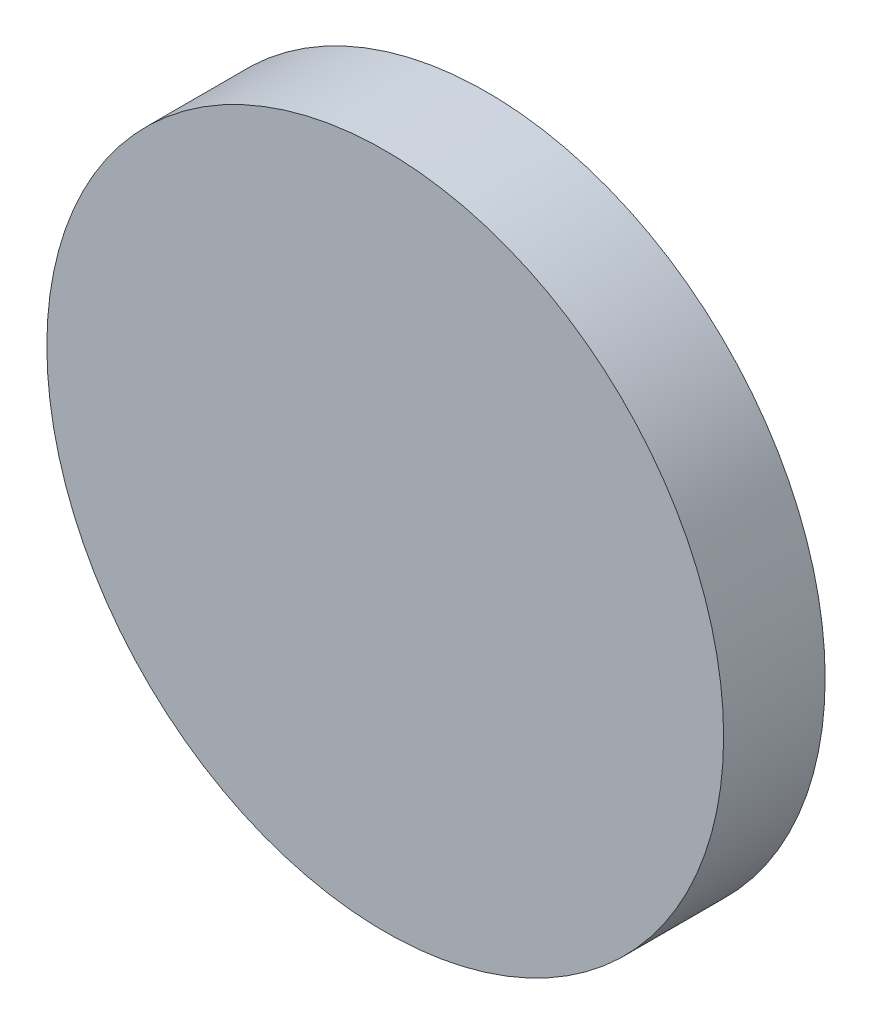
ISO-10303-21;
HEADER;
FILE_DESCRIPTION(('STEP AP214'),'2;1');
FILE_NAME('part.step','',(''),(''),'','','');
FILE_SCHEMA(('AUTOMOTIVE_DESIGN { 1 0 10303 214 1 1 1 1 }'));
ENDSEC;
DATA;
#1=APPLICATION_CONTEXT('core data for automotive mechanical design processes');
#2=APPLICATION_PROTOCOL_DEFINITION('international standard','automotive_design',2000,#1);
#3=PRODUCT_CONTEXT('',#1,'mechanical');
#4=PRODUCT('Part','Part','',(#3));
#5=PRODUCT_RELATED_PRODUCT_CATEGORY('part','',(#4));
#6=PRODUCT_DEFINITION_FORMATION('','',#4);
#7=PRODUCT_DEFINITION_CONTEXT('part definition',#1,'design');
#8=PRODUCT_DEFINITION('design','',#6,#7);
#9=PRODUCT_DEFINITION_SHAPE('','',#8);
#10=(LENGTH_UNIT() NAMED_UNIT(*) SI_UNIT(.MILLI.,.METRE.));
#11=(NAMED_UNIT(*) PLANE_ANGLE_UNIT() SI_UNIT($,.RADIAN.));
#12=(NAMED_UNIT(*) SI_UNIT($,.STERADIAN.) SOLID_ANGLE_UNIT());
#13=UNCERTAINTY_MEASURE_WITH_UNIT(LENGTH_MEASURE(1.E-05),#10,'distance_accuracy_value','');
#14=(GEOMETRIC_REPRESENTATION_CONTEXT(3) GLOBAL_UNCERTAINTY_ASSIGNED_CONTEXT((#13)) GLOBAL_UNIT_ASSIGNED_CONTEXT((#10,
#11,#12)) REPRESENTATION_CONTEXT('',''));
#15=CARTESIAN_POINT('',(0.,0.,0.));
#16=DIRECTION('',(0.,0.,1.));
#17=DIRECTION('',(1.,0.,0.));
#18=AXIS2_PLACEMENT_3D('',#15,#16,#17);
#19=CARTESIAN_POINT('',(-20.0000000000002,-26.1381816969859,-3.));
#20=DIRECTION('',(0.,0.,1.));
#21=DIRECTION('',(1.,0.,0.));
#22=AXIS2_PLACEMENT_3D('',#19,#20,#21);
#23=CYLINDRICAL_SURFACE('',#22,10.);
#24=CARTESIAN_POINT('',(-20.0000000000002,-26.1381816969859,-3.));
#25=DIRECTION('',(0.,0.,1.));
#26=DIRECTION('',(1.,0.,0.));
#27=AXIS2_PLACEMENT_3D('',#24,#25,#26);
#28=CIRCLE('',#27,10.);
#29=CARTESIAN_POINT('',(-10.0000000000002,-26.1381816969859,-3.));
#30=VERTEX_POINT('',#29);
#31=EDGE_CURVE('E10',#30,#30,#28,.T.);
#32=ORIENTED_EDGE('',*,*,#31,.T.);
#33=EDGE_LOOP('',(#32));
#34=FACE_BOUND('',#33,.T.);
#35=CARTESIAN_POINT('',(-20.0000000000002,-26.1381816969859,0.));
#36=DIRECTION('',(0.,0.,1.));
#37=DIRECTION('',(1.,0.,0.));
#38=AXIS2_PLACEMENT_3D('',#35,#36,#37);
#39=CIRCLE('',#38,10.);
#40=CARTESIAN_POINT('',(-10.0000000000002,-26.1381816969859,0.));
#41=VERTEX_POINT('',#40);
#42=EDGE_CURVE('E34',#41,#41,#39,.T.);
#43=ORIENTED_EDGE('',*,*,#42,.F.);
#44=EDGE_LOOP('',(#43));
#45=FACE_BOUND('',#44,.T.);
#46=ADVANCED_FACE('F31',(#34,#45),#23,.T.);
#47=CARTESIAN_POINT('',(-20.0000000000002,-26.1381816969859,-3.));
#48=DIRECTION('',(0.,0.,1.));
#49=DIRECTION('',(1.,0.,0.));
#50=AXIS2_PLACEMENT_3D('',#47,#48,#49);
#51=PLANE('',#50);
#52=ORIENTED_EDGE('',*,*,#31,.F.);
#53=EDGE_LOOP('',(#52));
#54=FACE_BOUND('',#53,.T.);
#55=ADVANCED_FACE('F46',(#54),#51,.F.);
#56=CARTESIAN_POINT('',(-20.0000000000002,-26.1381816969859,0.));
#57=DIRECTION('',(0.,0.,1.));
#58=DIRECTION('',(1.,0.,0.));
#59=AXIS2_PLACEMENT_3D('',#56,#57,#58);
#60=PLANE('',#59);
#61=ORIENTED_EDGE('',*,*,#42,.T.);
#62=EDGE_LOOP('',(#61));
#63=FACE_BOUND('',#62,.T.);
#64=ADVANCED_FACE('F43',(#63),#60,.T.);
#65=CLOSED_SHELL('',(#46,#55,#64));
#66=MANIFOLD_SOLID_BREP('B2',#65);
#67=ADVANCED_BREP_SHAPE_REPRESENTATION('',(#18,#66),#14);
#68=SHAPE_DEFINITION_REPRESENTATION(#9,#67);
ENDSEC;
END-ISO-10303-21;
